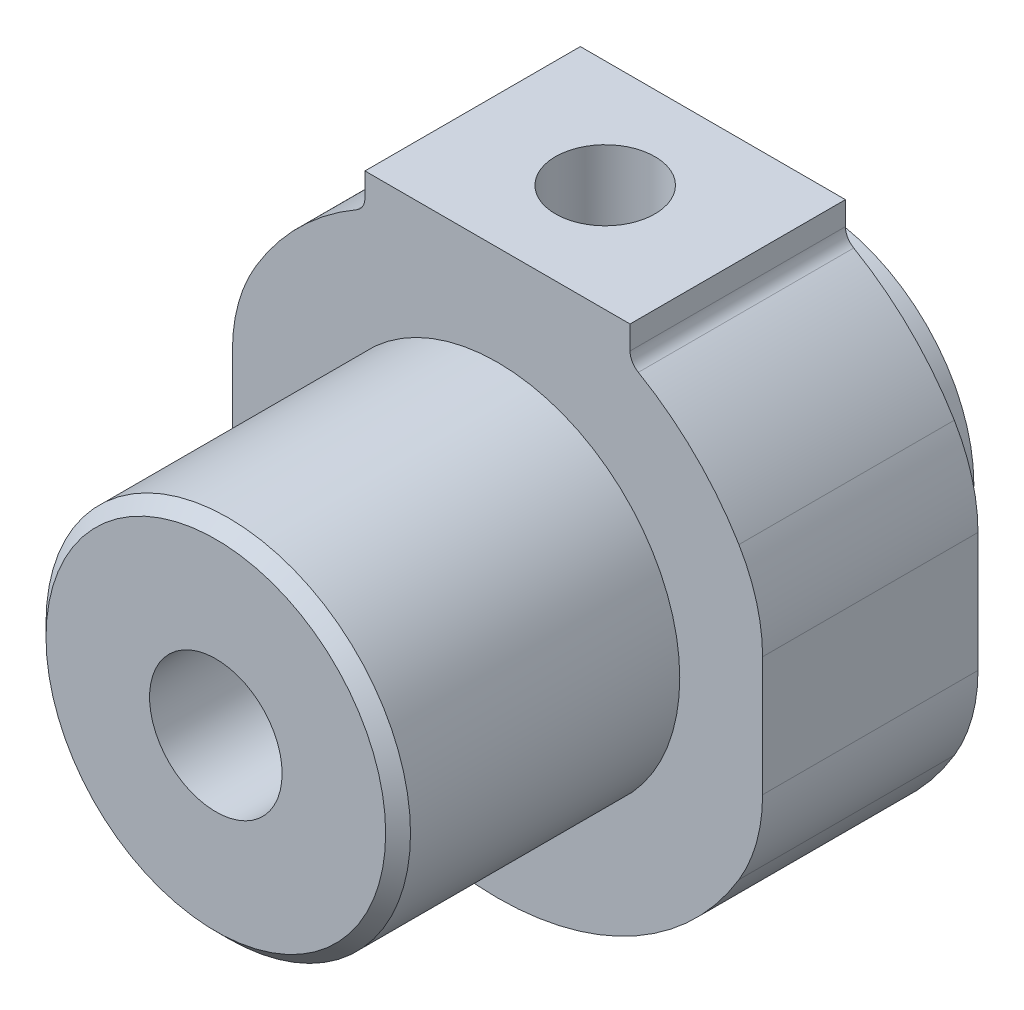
ISO-10303-21;
HEADER;
FILE_DESCRIPTION(('STEP AP214'),'2;1');
FILE_NAME('part.step','',(''),(''),'','','');
FILE_SCHEMA(('AUTOMOTIVE_DESIGN { 1 0 10303 214 1 1 1 1 }'));
ENDSEC;
DATA;
#1=APPLICATION_CONTEXT('core data for automotive mechanical design processes');
#2=APPLICATION_PROTOCOL_DEFINITION('international standard','automotive_design',2000,#1);
#3=PRODUCT_CONTEXT('',#1,'mechanical');
#4=PRODUCT('Part','Part','',(#3));
#5=PRODUCT_RELATED_PRODUCT_CATEGORY('part','',(#4));
#6=PRODUCT_DEFINITION_FORMATION('','',#4);
#7=PRODUCT_DEFINITION_CONTEXT('part definition',#1,'design');
#8=PRODUCT_DEFINITION('design','',#6,#7);
#9=PRODUCT_DEFINITION_SHAPE('','',#8);
#10=(LENGTH_UNIT() NAMED_UNIT(*) SI_UNIT(.MILLI.,.METRE.));
#11=(NAMED_UNIT(*) PLANE_ANGLE_UNIT() SI_UNIT($,.RADIAN.));
#12=(NAMED_UNIT(*) SI_UNIT($,.STERADIAN.) SOLID_ANGLE_UNIT());
#13=UNCERTAINTY_MEASURE_WITH_UNIT(LENGTH_MEASURE(1.E-05),#10,'distance_accuracy_value','');
#14=(GEOMETRIC_REPRESENTATION_CONTEXT(3) GLOBAL_UNCERTAINTY_ASSIGNED_CONTEXT((#13)) GLOBAL_UNIT_ASSIGNED_CONTEXT((#10,
#11,#12)) REPRESENTATION_CONTEXT('',''));
#15=CARTESIAN_POINT('',(0.,0.,0.));
#16=DIRECTION('',(0.,0.,1.));
#17=DIRECTION('',(1.,0.,0.));
#18=AXIS2_PLACEMENT_3D('',#15,#16,#17);
#19=CARTESIAN_POINT('',(0.,0.,13.));
#20=DIRECTION('',(0.,0.,-1.));
#21=DIRECTION('',(-1.,0.,0.));
#22=AXIS2_PLACEMENT_3D('',#19,#20,#21);
#23=CYLINDRICAL_SURFACE('',#22,17.);
#24=CARTESIAN_POINT('',(0.,0.,13.));
#25=DIRECTION('',(0.,0.,1.));
#26=DIRECTION('',(1.,0.,0.));
#27=AXIS2_PLACEMENT_3D('',#24,#25,#26);
#28=CIRCLE('',#27,17.);
#29=CARTESIAN_POINT('',(-14.5714285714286,-8.75633881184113,13.));
#30=VERTEX_POINT('',#29);
#31=CARTESIAN_POINT('',(14.5714285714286,-8.75633881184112,13.));
#32=VERTEX_POINT('',#31);
#33=EDGE_CURVE('E190',#30,#32,#28,.T.);
#34=ORIENTED_EDGE('',*,*,#33,.F.);
#35=DIRECTION('',(0.,0.,-1.));
#36=VECTOR('',#35,1.);
#37=CARTESIAN_POINT('',(-14.5714285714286,-8.75633881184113,13.));
#38=LINE('',#37,#36);
#39=CARTESIAN_POINT('',(-14.5714285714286,-8.75633881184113,0.));
#40=VERTEX_POINT('',#39);
#41=EDGE_CURVE('E236',#30,#40,#38,.T.);
#42=ORIENTED_EDGE('',*,*,#41,.T.);
#43=CARTESIAN_POINT('',(0.,0.,0.));
#44=DIRECTION('',(0.,0.,1.));
#45=DIRECTION('',(1.,0.,0.));
#46=AXIS2_PLACEMENT_3D('',#43,#44,#45);
#47=CIRCLE('',#46,17.);
#48=CARTESIAN_POINT('',(14.5714285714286,-8.75633881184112,0.));
#49=VERTEX_POINT('',#48);
#50=EDGE_CURVE('E175',#40,#49,#47,.T.);
#51=ORIENTED_EDGE('',*,*,#50,.T.);
#52=DIRECTION('',(0.,0.,-1.));
#53=VECTOR('',#52,1.);
#54=CARTESIAN_POINT('',(14.5714285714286,-8.75633881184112,13.));
#55=LINE('',#54,#53);
#56=EDGE_CURVE('E233',#49,#32,#55,.F.);
#57=ORIENTED_EDGE('',*,*,#56,.T.);
#58=EDGE_LOOP('',(#34,#42,#51,#57));
#59=FACE_BOUND('',#58,.T.);
#60=ADVANCED_FACE('F28',(#59),#23,.T.);
#61=CARTESIAN_POINT('',(14.5714285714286,8.75633881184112,13.));
#62=VERTEX_POINT('',#61);
#63=CARTESIAN_POINT('',(8.49999999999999,14.7224318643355,13.));
#64=VERTEX_POINT('',#63);
#65=EDGE_CURVE('E186',#62,#64,#28,.T.);
#66=ORIENTED_EDGE('',*,*,#65,.F.);
#67=DIRECTION('',(0.,0.,-1.));
#68=VECTOR('',#67,1.);
#69=CARTESIAN_POINT('',(14.5714285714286,8.75633881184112,13.));
#70=LINE('',#69,#68);
#71=CARTESIAN_POINT('',(14.5714285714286,8.75633881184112,0.));
#72=VERTEX_POINT('',#71);
#73=EDGE_CURVE('E11',#62,#72,#70,.T.);
#74=ORIENTED_EDGE('',*,*,#73,.T.);
#75=CARTESIAN_POINT('',(8.49999999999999,14.7224318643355,0.));
#76=VERTEX_POINT('',#75);
#77=EDGE_CURVE('E170',#72,#76,#47,.T.);
#78=ORIENTED_EDGE('',*,*,#77,.T.);
#79=DIRECTION('',(0.,0.,-1.));
#80=VECTOR('',#79,1.);
#81=CARTESIAN_POINT('',(8.49999999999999,14.7224318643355,13.));
#82=LINE('',#81,#80);
#83=EDGE_CURVE('E150',#64,#76,#82,.T.);
#84=ORIENTED_EDGE('',*,*,#83,.F.);
#85=EDGE_LOOP('',(#66,#74,#78,#84));
#86=FACE_BOUND('',#85,.T.);
#87=ADVANCED_FACE('F265',(#86),#23,.T.);
#88=CARTESIAN_POINT('',(9.,15.5884572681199,0.));
#89=DIRECTION('',(0.,0.,-1.));
#90=DIRECTION('',(-1.,0.,0.));
#91=AXIS2_PLACEMENT_3D('',#88,#89,#90);
#92=PLANE('',#91);
#93=DIRECTION('',(0.,-1.,0.));
#94=VECTOR('',#93,1.);
#95=CARTESIAN_POINT('',(-16.,20.,0.));
#96=LINE('',#95,#94);
#97=CARTESIAN_POINT('',(-16.,3.60555127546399,0.));
#98=VERTEX_POINT('',#97);
#99=CARTESIAN_POINT('',(-16.,-3.60555127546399,0.));
#100=VERTEX_POINT('',#99);
#101=EDGE_CURVE('E333',#98,#100,#96,.T.);
#102=ORIENTED_EDGE('',*,*,#101,.F.);
#103=CARTESIAN_POINT('',(-6.,3.60555127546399,0.));
#104=DIRECTION('',(0.,0.,-1.));
#105=DIRECTION('',(-1.,0.,0.));
#106=AXIS2_PLACEMENT_3D('',#103,#104,#105);
#107=CIRCLE('',#106,10.);
#108=CARTESIAN_POINT('',(-14.5714285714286,8.75633881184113,0.));
#109=VERTEX_POINT('',#108);
#110=EDGE_CURVE('E231',#98,#109,#107,.T.);
#111=ORIENTED_EDGE('',*,*,#110,.T.);
#112=CARTESIAN_POINT('',(-8.5,14.7224318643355,0.));
#113=VERTEX_POINT('',#112);
#114=EDGE_CURVE('E171',#113,#109,#47,.T.);
#115=ORIENTED_EDGE('',*,*,#114,.F.);
#116=CARTESIAN_POINT('',(-9.,15.5884572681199,0.));
#117=DIRECTION('',(0.,0.,1.));
#118=DIRECTION('',(1.,0.,0.));
#119=AXIS2_PLACEMENT_3D('',#116,#117,#118);
#120=CIRCLE('',#119,1.);
#121=CARTESIAN_POINT('',(-8.,15.5884572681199,0.));
#122=VERTEX_POINT('',#121);
#123=EDGE_CURVE('E167',#113,#122,#120,.T.);
#124=ORIENTED_EDGE('',*,*,#123,.T.);
#125=DIRECTION('',(0.,-1.,0.));
#126=VECTOR('',#125,1.);
#127=CARTESIAN_POINT('',(-8.,17.,0.));
#128=LINE('',#127,#126);
#129=CARTESIAN_POINT('',(-8.,17.,0.));
#130=VERTEX_POINT('',#129);
#131=EDGE_CURVE('E161',#130,#122,#128,.T.);
#132=ORIENTED_EDGE('',*,*,#131,.F.);
#133=DIRECTION('',(1.,0.,0.));
#134=VECTOR('',#133,1.);
#135=CARTESIAN_POINT('',(-8.,17.,0.));
#136=LINE('',#135,#134);
#137=CARTESIAN_POINT('',(8.,17.,0.));
#138=VERTEX_POINT('',#137);
#139=EDGE_CURVE('E159',#130,#138,#136,.T.);
#140=ORIENTED_EDGE('',*,*,#139,.T.);
#141=DIRECTION('',(0.,-1.,0.));
#142=VECTOR('',#141,1.);
#143=CARTESIAN_POINT('',(8.,17.,0.));
#144=LINE('',#143,#142);
#145=CARTESIAN_POINT('',(8.,15.5884572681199,0.));
#146=VERTEX_POINT('',#145);
#147=EDGE_CURVE('E137',#138,#146,#144,.T.);
#148=ORIENTED_EDGE('',*,*,#147,.T.);
#149=CARTESIAN_POINT('',(9.,15.5884572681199,0.));
#150=DIRECTION('',(0.,0.,-1.));
#151=DIRECTION('',(-1.,0.,0.));
#152=AXIS2_PLACEMENT_3D('',#149,#150,#151);
#153=CIRCLE('',#152,1.);
#154=EDGE_CURVE('E148',#76,#146,#153,.T.);
#155=ORIENTED_EDGE('',*,*,#154,.F.);
#156=ORIENTED_EDGE('',*,*,#77,.F.);
#157=CARTESIAN_POINT('',(6.,3.60555127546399,0.));
#158=DIRECTION('',(0.,0.,-1.));
#159=DIRECTION('',(-1.,0.,0.));
#160=AXIS2_PLACEMENT_3D('',#157,#158,#159);
#161=CIRCLE('',#160,10.);
#162=CARTESIAN_POINT('',(16.,3.60555127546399,0.));
#163=VERTEX_POINT('',#162);
#164=EDGE_CURVE('E227',#72,#163,#161,.T.);
#165=ORIENTED_EDGE('',*,*,#164,.T.);
#166=DIRECTION('',(0.,1.,0.));
#167=VECTOR('',#166,1.);
#168=CARTESIAN_POINT('',(16.,20.,0.));
#169=LINE('',#168,#167);
#170=CARTESIAN_POINT('',(16.,-3.60555127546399,0.));
#171=VERTEX_POINT('',#170);
#172=EDGE_CURVE('E244',#171,#163,#169,.T.);
#173=ORIENTED_EDGE('',*,*,#172,.F.);
#174=CARTESIAN_POINT('',(6.,-3.60555127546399,0.));
#175=DIRECTION('',(0.,0.,-1.));
#176=DIRECTION('',(-1.,0.,0.));
#177=AXIS2_PLACEMENT_3D('',#174,#175,#176);
#178=CIRCLE('',#177,10.);
#179=EDGE_CURVE('E43',#171,#49,#178,.T.);
#180=ORIENTED_EDGE('',*,*,#179,.T.);
#181=ORIENTED_EDGE('',*,*,#50,.F.);
#182=CARTESIAN_POINT('',(-6.,-3.60555127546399,0.));
#183=DIRECTION('',(0.,0.,-1.));
#184=DIRECTION('',(-1.,0.,0.));
#185=AXIS2_PLACEMENT_3D('',#182,#183,#184);
#186=CIRCLE('',#185,10.);
#187=EDGE_CURVE('E51',#40,#100,#186,.T.);
#188=ORIENTED_EDGE('',*,*,#187,.T.);
#189=EDGE_LOOP('',(#102,#111,#115,#124,#132,#140,#148,#155,#156,#165,#173,#180,#181,#188));
#190=FACE_BOUND('',#189,.T.);
#191=CARTESIAN_POINT('',(0.,0.,0.));
#192=DIRECTION('',(0.,0.,-1.));
#193=DIRECTION('',(-1.,0.,0.));
#194=AXIS2_PLACEMENT_3D('',#191,#192,#193);
#195=CIRCLE('',#194,9.);
#196=CARTESIAN_POINT('',(-9.,0.,0.));
#197=VERTEX_POINT('',#196);
#198=EDGE_CURVE('E414',#197,#197,#195,.T.);
#199=ORIENTED_EDGE('',*,*,#198,.F.);
#200=EDGE_LOOP('',(#199));
#201=FACE_BOUND('',#200,.T.);
#202=ADVANCED_FACE('F155',(#190,#201),#92,.T.);
#203=CARTESIAN_POINT('',(9.,15.5884572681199,13.));
#204=DIRECTION('',(0.,0.,-1.));
#205=DIRECTION('',(-1.,0.,0.));
#206=AXIS2_PLACEMENT_3D('',#203,#204,#205);
#207=PLANE('',#206);
#208=CARTESIAN_POINT('',(-8.5,14.7224318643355,13.));
#209=VERTEX_POINT('',#208);
#210=CARTESIAN_POINT('',(-14.5714285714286,8.75633881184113,13.));
#211=VERTEX_POINT('',#210);
#212=EDGE_CURVE('E187',#209,#211,#28,.T.);
#213=ORIENTED_EDGE('',*,*,#212,.T.);
#214=CARTESIAN_POINT('',(-6.,3.60555127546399,13.));
#215=DIRECTION('',(0.,0.,-1.));
#216=DIRECTION('',(-1.,0.,0.));
#217=AXIS2_PLACEMENT_3D('',#214,#215,#216);
#218=CIRCLE('',#217,10.);
#219=CARTESIAN_POINT('',(-16.,3.605551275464,13.));
#220=VERTEX_POINT('',#219);
#221=EDGE_CURVE('E221',#211,#220,#218,.F.);
#222=ORIENTED_EDGE('',*,*,#221,.T.);
#223=DIRECTION('',(0.,-1.,0.));
#224=VECTOR('',#223,1.);
#225=CARTESIAN_POINT('',(-16.,15.5884572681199,13.));
#226=LINE('',#225,#224);
#227=CARTESIAN_POINT('',(-16.,-3.60555127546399,13.));
#228=VERTEX_POINT('',#227);
#229=EDGE_CURVE('E249',#220,#228,#226,.T.);
#230=ORIENTED_EDGE('',*,*,#229,.T.);
#231=CARTESIAN_POINT('',(-6.,-3.60555127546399,13.));
#232=DIRECTION('',(0.,0.,-1.));
#233=DIRECTION('',(-1.,0.,0.));
#234=AXIS2_PLACEMENT_3D('',#231,#232,#233);
#235=CIRCLE('',#234,10.);
#236=EDGE_CURVE('E219',#228,#30,#235,.F.);
#237=ORIENTED_EDGE('',*,*,#236,.T.);
#238=ORIENTED_EDGE('',*,*,#33,.T.);
#239=CARTESIAN_POINT('',(6.,-3.60555127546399,13.));
#240=DIRECTION('',(0.,0.,-1.));
#241=DIRECTION('',(-1.,0.,0.));
#242=AXIS2_PLACEMENT_3D('',#239,#240,#241);
#243=CIRCLE('',#242,10.);
#244=CARTESIAN_POINT('',(16.,-3.605551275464,13.));
#245=VERTEX_POINT('',#244);
#246=EDGE_CURVE('E217',#32,#245,#243,.F.);
#247=ORIENTED_EDGE('',*,*,#246,.T.);
#248=DIRECTION('',(0.,1.,0.));
#249=VECTOR('',#248,1.);
#250=CARTESIAN_POINT('',(16.,15.5884572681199,13.));
#251=LINE('',#250,#249);
#252=CARTESIAN_POINT('',(16.,3.60555127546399,13.));
#253=VERTEX_POINT('',#252);
#254=EDGE_CURVE('E247',#245,#253,#251,.T.);
#255=ORIENTED_EDGE('',*,*,#254,.T.);
#256=CARTESIAN_POINT('',(6.,3.60555127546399,13.));
#257=DIRECTION('',(0.,0.,-1.));
#258=DIRECTION('',(-1.,0.,0.));
#259=AXIS2_PLACEMENT_3D('',#256,#257,#258);
#260=CIRCLE('',#259,10.);
#261=EDGE_CURVE('E215',#253,#62,#260,.F.);
#262=ORIENTED_EDGE('',*,*,#261,.T.);
#263=ORIENTED_EDGE('',*,*,#65,.T.);
#264=CARTESIAN_POINT('',(9.,15.5884572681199,13.));
#265=DIRECTION('',(0.,0.,-1.));
#266=DIRECTION('',(-1.,0.,0.));
#267=AXIS2_PLACEMENT_3D('',#264,#265,#266);
#268=CIRCLE('',#267,1.);
#269=CARTESIAN_POINT('',(8.,15.5884572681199,13.));
#270=VERTEX_POINT('',#269);
#271=EDGE_CURVE('E174',#64,#270,#268,.T.);
#272=ORIENTED_EDGE('',*,*,#271,.T.);
#273=DIRECTION('',(0.,-1.,0.));
#274=VECTOR('',#273,1.);
#275=CARTESIAN_POINT('',(8.,17.,13.));
#276=LINE('',#275,#274);
#277=CARTESIAN_POINT('',(8.,17.,13.));
#278=VERTEX_POINT('',#277);
#279=EDGE_CURVE('E140',#278,#270,#276,.T.);
#280=ORIENTED_EDGE('',*,*,#279,.F.);
#281=DIRECTION('',(1.,0.,0.));
#282=VECTOR('',#281,1.);
#283=CARTESIAN_POINT('',(-8.,17.,13.));
#284=LINE('',#283,#282);
#285=CARTESIAN_POINT('',(-8.,17.,13.));
#286=VERTEX_POINT('',#285);
#287=EDGE_CURVE('E178',#286,#278,#284,.T.);
#288=ORIENTED_EDGE('',*,*,#287,.F.);
#289=DIRECTION('',(0.,-1.,0.));
#290=VECTOR('',#289,1.);
#291=CARTESIAN_POINT('',(-8.,17.,13.));
#292=LINE('',#291,#290);
#293=CARTESIAN_POINT('',(-8.,15.5884572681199,13.));
#294=VERTEX_POINT('',#293);
#295=EDGE_CURVE('E181',#286,#294,#292,.T.);
#296=ORIENTED_EDGE('',*,*,#295,.T.);
#297=CARTESIAN_POINT('',(-9.,15.5884572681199,13.));
#298=DIRECTION('',(0.,0.,1.));
#299=DIRECTION('',(1.,0.,0.));
#300=AXIS2_PLACEMENT_3D('',#297,#298,#299);
#301=CIRCLE('',#300,1.);
#302=EDGE_CURVE('E183',#209,#294,#301,.T.);
#303=ORIENTED_EDGE('',*,*,#302,.F.);
#304=EDGE_LOOP('',(#213,#222,#230,#237,#238,#247,#255,#262,#263,#272,#280,#288,#296,#303));
#305=FACE_BOUND('',#304,.T.);
#306=CARTESIAN_POINT('',(0.,0.,13.));
#307=DIRECTION('',(0.,0.,-1.));
#308=DIRECTION('',(-1.,0.,0.));
#309=AXIS2_PLACEMENT_3D('',#306,#307,#308);
#310=CIRCLE('',#309,11.);
#311=CARTESIAN_POINT('',(-11.,0.,13.));
#312=VERTEX_POINT('',#311);
#313=EDGE_CURVE('E143',#312,#312,#310,.F.);
#314=ORIENTED_EDGE('',*,*,#313,.F.);
#315=EDGE_LOOP('',(#314));
#316=FACE_BOUND('',#315,.T.);
#317=ADVANCED_FACE('F257',(#305,#316),#207,.F.);
#318=CARTESIAN_POINT('',(9.,15.5884572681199,13.));
#319=DIRECTION('',(0.,0.,-1.));
#320=DIRECTION('',(-1.,0.,0.));
#321=AXIS2_PLACEMENT_3D('',#318,#319,#320);
#322=CYLINDRICAL_SURFACE('',#321,1.);
#323=ORIENTED_EDGE('',*,*,#154,.T.);
#324=DIRECTION('',(0.,0.,-1.));
#325=VECTOR('',#324,1.);
#326=CARTESIAN_POINT('',(8.,15.5884572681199,13.));
#327=LINE('',#326,#325);
#328=EDGE_CURVE('E133',#270,#146,#327,.T.);
#329=ORIENTED_EDGE('',*,*,#328,.F.);
#330=ORIENTED_EDGE('',*,*,#271,.F.);
#331=ORIENTED_EDGE('',*,*,#83,.T.);
#332=EDGE_LOOP('',(#323,#329,#330,#331));
#333=FACE_BOUND('',#332,.T.);
#334=ADVANCED_FACE('F30',(#333),#322,.F.);
#335=CARTESIAN_POINT('',(8.,17.,13.));
#336=DIRECTION('',(1.,0.,0.));
#337=DIRECTION('',(0.,0.,-1.));
#338=AXIS2_PLACEMENT_3D('',#335,#336,#337);
#339=PLANE('',#338);
#340=ORIENTED_EDGE('',*,*,#147,.F.);
#341=DIRECTION('',(0.,0.,-1.));
#342=VECTOR('',#341,1.);
#343=CARTESIAN_POINT('',(8.,17.,13.));
#344=LINE('',#343,#342);
#345=EDGE_CURVE('E144',#278,#138,#344,.T.);
#346=ORIENTED_EDGE('',*,*,#345,.F.);
#347=ORIENTED_EDGE('',*,*,#279,.T.);
#348=ORIENTED_EDGE('',*,*,#328,.T.);
#349=EDGE_LOOP('',(#340,#346,#347,#348));
#350=FACE_BOUND('',#349,.T.);
#351=ADVANCED_FACE('F135',(#350),#339,.T.);
#352=CARTESIAN_POINT('',(-8.,17.,13.));
#353=DIRECTION('',(0.,1.,0.));
#354=DIRECTION('',(0.,0.,1.));
#355=AXIS2_PLACEMENT_3D('',#352,#353,#354);
#356=PLANE('',#355);
#357=CARTESIAN_POINT('',(0.,17.,6.5));
#358=DIRECTION('',(0.,1.,0.));
#359=DIRECTION('',(-1.,0.,0.));
#360=AXIS2_PLACEMENT_3D('',#357,#358,#359);
#361=CIRCLE('',#360,3.);
#362=CARTESIAN_POINT('',(-3.,17.,6.5));
#363=VERTEX_POINT('',#362);
#364=EDGE_CURVE('E271',#363,#363,#361,.T.);
#365=ORIENTED_EDGE('',*,*,#364,.F.);
#366=EDGE_LOOP('',(#365));
#367=FACE_BOUND('',#366,.T.);
#368=ORIENTED_EDGE('',*,*,#139,.F.);
#369=DIRECTION('',(0.,0.,-1.));
#370=VECTOR('',#369,1.);
#371=CARTESIAN_POINT('',(-8.,17.,13.));
#372=LINE('',#371,#370);
#373=EDGE_CURVE('E196',#286,#130,#372,.T.);
#374=ORIENTED_EDGE('',*,*,#373,.F.);
#375=ORIENTED_EDGE('',*,*,#287,.T.);
#376=ORIENTED_EDGE('',*,*,#345,.T.);
#377=EDGE_LOOP('',(#368,#374,#375,#376));
#378=FACE_BOUND('',#377,.T.);
#379=ADVANCED_FACE('F340',(#367,#378),#356,.T.);
#380=CARTESIAN_POINT('',(-8.,17.,13.));
#381=DIRECTION('',(1.,0.,0.));
#382=DIRECTION('',(0.,0.,-1.));
#383=AXIS2_PLACEMENT_3D('',#380,#381,#382);
#384=PLANE('',#383);
#385=ORIENTED_EDGE('',*,*,#131,.T.);
#386=DIRECTION('',(0.,0.,-1.));
#387=VECTOR('',#386,1.);
#388=CARTESIAN_POINT('',(-8.,15.5884572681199,13.));
#389=LINE('',#388,#387);
#390=EDGE_CURVE('E194',#294,#122,#389,.T.);
#391=ORIENTED_EDGE('',*,*,#390,.F.);
#392=ORIENTED_EDGE('',*,*,#295,.F.);
#393=ORIENTED_EDGE('',*,*,#373,.T.);
#394=EDGE_LOOP('',(#385,#391,#392,#393));
#395=FACE_BOUND('',#394,.T.);
#396=ADVANCED_FACE('F322',(#395),#384,.F.);
#397=CARTESIAN_POINT('',(-9.,15.5884572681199,13.));
#398=DIRECTION('',(0.,0.,-1.));
#399=DIRECTION('',(-1.,0.,0.));
#400=AXIS2_PLACEMENT_3D('',#397,#398,#399);
#401=CYLINDRICAL_SURFACE('',#400,1.);
#402=ORIENTED_EDGE('',*,*,#123,.F.);
#403=DIRECTION('',(0.,0.,-1.));
#404=VECTOR('',#403,1.);
#405=CARTESIAN_POINT('',(-8.5,14.7224318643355,13.));
#406=LINE('',#405,#404);
#407=EDGE_CURVE('E192',#209,#113,#406,.T.);
#408=ORIENTED_EDGE('',*,*,#407,.F.);
#409=ORIENTED_EDGE('',*,*,#302,.T.);
#410=ORIENTED_EDGE('',*,*,#390,.T.);
#411=EDGE_LOOP('',(#402,#408,#409,#410));
#412=FACE_BOUND('',#411,.T.);
#413=ADVANCED_FACE('F313',(#412),#401,.F.);
#414=ORIENTED_EDGE('',*,*,#114,.T.);
#415=DIRECTION('',(0.,0.,-1.));
#416=VECTOR('',#415,1.);
#417=CARTESIAN_POINT('',(-14.5714285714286,8.75633881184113,13.));
#418=LINE('',#417,#416);
#419=EDGE_CURVE('E207',#109,#211,#418,.F.);
#420=ORIENTED_EDGE('',*,*,#419,.T.);
#421=ORIENTED_EDGE('',*,*,#212,.F.);
#422=ORIENTED_EDGE('',*,*,#407,.T.);
#423=EDGE_LOOP('',(#414,#420,#421,#422));
#424=FACE_BOUND('',#423,.T.);
#425=ADVANCED_FACE('F305',(#424),#23,.T.);
#426=CARTESIAN_POINT('',(0.,0.,30.));
#427=DIRECTION('',(0.,0.,-1.));
#428=DIRECTION('',(-1.,0.,0.));
#429=AXIS2_PLACEMENT_3D('',#426,#427,#428);
#430=CYLINDRICAL_SURFACE('',#429,11.);
#431=CARTESIAN_POINT('',(0.,0.,29.25));
#432=DIRECTION('',(0.,0.,1.));
#433=DIRECTION('',(1.,0.,0.));
#434=AXIS2_PLACEMENT_3D('',#431,#432,#433);
#435=CIRCLE('',#434,11.);
#436=CARTESIAN_POINT('',(11.,0.,29.25));
#437=VERTEX_POINT('',#436);
#438=EDGE_CURVE('E204',#437,#437,#435,.F.);
#439=ORIENTED_EDGE('',*,*,#438,.T.);
#440=EDGE_LOOP('',(#439));
#441=FACE_BOUND('',#440,.T.);
#442=ORIENTED_EDGE('',*,*,#313,.T.);
#443=EDGE_LOOP('',(#442));
#444=FACE_BOUND('',#443,.T.);
#445=ADVANCED_FACE('F312',(#441,#444),#430,.T.);
#446=CARTESIAN_POINT('',(0.,0.,30.));
#447=DIRECTION('',(0.,0.,1.));
#448=DIRECTION('',(1.,0.,0.));
#449=AXIS2_PLACEMENT_3D('',#446,#447,#448);
#450=PLANE('',#449);
#451=CARTESIAN_POINT('',(0.,0.,30.));
#452=DIRECTION('',(0.,0.,1.));
#453=DIRECTION('',(1.,0.,0.));
#454=AXIS2_PLACEMENT_3D('',#451,#452,#453);
#455=CIRCLE('',#454,4.);
#456=CARTESIAN_POINT('',(4.,0.,30.));
#457=VERTEX_POINT('',#456);
#458=EDGE_CURVE('E212',#457,#457,#455,.T.);
#459=ORIENTED_EDGE('',*,*,#458,.F.);
#460=EDGE_LOOP('',(#459));
#461=FACE_BOUND('',#460,.T.);
#462=CARTESIAN_POINT('',(0.,0.,30.));
#463=DIRECTION('',(0.,0.,1.));
#464=DIRECTION('',(1.,0.,0.));
#465=AXIS2_PLACEMENT_3D('',#462,#463,#464);
#466=CIRCLE('',#465,10.25);
#467=CARTESIAN_POINT('',(10.25,0.,30.));
#468=VERTEX_POINT('',#467);
#469=EDGE_CURVE('E201',#468,#468,#466,.T.);
#470=ORIENTED_EDGE('',*,*,#469,.T.);
#471=EDGE_LOOP('',(#470));
#472=FACE_BOUND('',#471,.T.);
#473=ADVANCED_FACE('F319',(#461,#472),#450,.T.);
#474=CARTESIAN_POINT('',(0.,0.,30.));
#475=DIRECTION('',(0.,0.,-1.));
#476=DIRECTION('',(-1.,0.,0.));
#477=AXIS2_PLACEMENT_3D('',#474,#475,#476);
#478=CONICAL_SURFACE('',#477,10.25,0.785398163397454);
#479=ORIENTED_EDGE('',*,*,#438,.F.);
#480=EDGE_LOOP('',(#479));
#481=FACE_BOUND('',#480,.T.);
#482=ORIENTED_EDGE('',*,*,#469,.F.);
#483=EDGE_LOOP('',(#482));
#484=FACE_BOUND('',#483,.T.);
#485=ADVANCED_FACE('F362',(#481,#484),#478,.T.);
#486=CARTESIAN_POINT('',(0.,0.,-3.));
#487=DIRECTION('',(0.,0.,1.));
#488=DIRECTION('',(1.,0.,0.));
#489=AXIS2_PLACEMENT_3D('',#486,#487,#488);
#490=CYLINDRICAL_SURFACE('',#489,9.);
#491=CARTESIAN_POINT('',(0.,0.,-3.));
#492=DIRECTION('',(0.,0.,-1.));
#493=DIRECTION('',(-1.,0.,0.));
#494=AXIS2_PLACEMENT_3D('',#491,#492,#493);
#495=CIRCLE('',#494,9.);
#496=CARTESIAN_POINT('',(-9.,0.,-3.));
#497=VERTEX_POINT('',#496);
#498=EDGE_CURVE('E152',#497,#497,#495,.T.);
#499=ORIENTED_EDGE('',*,*,#498,.F.);
#500=EDGE_LOOP('',(#499));
#501=FACE_BOUND('',#500,.T.);
#502=ORIENTED_EDGE('',*,*,#198,.T.);
#503=EDGE_LOOP('',(#502));
#504=FACE_BOUND('',#503,.T.);
#505=ADVANCED_FACE('F366',(#501,#504),#490,.T.);
#506=CARTESIAN_POINT('',(0.,0.,-3.));
#507=DIRECTION('',(0.,0.,-1.));
#508=DIRECTION('',(-1.,0.,0.));
#509=AXIS2_PLACEMENT_3D('',#506,#507,#508);
#510=PLANE('',#509);
#511=CARTESIAN_POINT('',(0.,0.,-3.));
#512=DIRECTION('',(0.,0.,-1.));
#513=DIRECTION('',(-1.,0.,0.));
#514=AXIS2_PLACEMENT_3D('',#511,#512,#513);
#515=CIRCLE('',#514,9.75);
#516=CARTESIAN_POINT('',(-9.75,0.,-3.));
#517=VERTEX_POINT('',#516);
#518=EDGE_CURVE('E408',#517,#517,#515,.T.);
#519=ORIENTED_EDGE('',*,*,#518,.F.);
#520=EDGE_LOOP('',(#519));
#521=FACE_BOUND('',#520,.T.);
#522=ORIENTED_EDGE('',*,*,#498,.T.);
#523=EDGE_LOOP('',(#522));
#524=FACE_BOUND('',#523,.T.);
#525=ADVANCED_FACE('F370',(#521,#524),#510,.F.);
#526=CARTESIAN_POINT('',(0.,0.,-6.));
#527=DIRECTION('',(0.,0.,1.));
#528=DIRECTION('',(1.,0.,0.));
#529=AXIS2_PLACEMENT_3D('',#526,#527,#528);
#530=CYLINDRICAL_SURFACE('',#529,9.75);
#531=CARTESIAN_POINT('',(0.,0.,-6.));
#532=DIRECTION('',(0.,0.,-1.));
#533=DIRECTION('',(-1.,0.,0.));
#534=AXIS2_PLACEMENT_3D('',#531,#532,#533);
#535=CIRCLE('',#534,9.75);
#536=CARTESIAN_POINT('',(-9.75,0.,-6.));
#537=VERTEX_POINT('',#536);
#538=EDGE_CURVE('E411',#537,#537,#535,.T.);
#539=ORIENTED_EDGE('',*,*,#538,.F.);
#540=EDGE_LOOP('',(#539));
#541=FACE_BOUND('',#540,.T.);
#542=ORIENTED_EDGE('',*,*,#518,.T.);
#543=EDGE_LOOP('',(#542));
#544=FACE_BOUND('',#543,.T.);
#545=ADVANCED_FACE('F372',(#541,#544),#530,.T.);
#546=CARTESIAN_POINT('',(0.,0.,-6.));
#547=DIRECTION('',(0.,0.,-1.));
#548=DIRECTION('',(-1.,0.,0.));
#549=AXIS2_PLACEMENT_3D('',#546,#547,#548);
#550=PLANE('',#549);
#551=CARTESIAN_POINT('',(0.,0.,-6.));
#552=DIRECTION('',(0.,0.,-1.));
#553=DIRECTION('',(-1.,0.,0.));
#554=AXIS2_PLACEMENT_3D('',#551,#552,#553);
#555=CIRCLE('',#554,5.);
#556=CARTESIAN_POINT('',(-5.,0.,-6.));
#557=VERTEX_POINT('',#556);
#558=EDGE_CURVE('E211',#557,#557,#555,.T.);
#559=ORIENTED_EDGE('',*,*,#558,.F.);
#560=EDGE_LOOP('',(#559));
#561=FACE_BOUND('',#560,.T.);
#562=ORIENTED_EDGE('',*,*,#538,.T.);
#563=EDGE_LOOP('',(#562));
#564=FACE_BOUND('',#563,.T.);
#565=ADVANCED_FACE('F375',(#561,#564),#550,.T.);
#566=CARTESIAN_POINT('',(0.,0.,14.));
#567=DIRECTION('',(0.,0.,-1.));
#568=DIRECTION('',(-1.,0.,0.));
#569=AXIS2_PLACEMENT_3D('',#566,#567,#568);
#570=CYLINDRICAL_SURFACE('',#569,5.);
#571=CARTESIAN_POINT('',(-3.,4.,6.5));
#572=CARTESIAN_POINT('',(-2.9999999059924,3.99999997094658,6.42453838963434));
#573=CARTESIAN_POINT('',(-2.99714660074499,4.00214560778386,6.34908004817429));
#574=CARTESIAN_POINT('',(-2.98579602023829,4.01061905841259,6.19881642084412));
#575=CARTESIAN_POINT('',(-2.97729658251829,4.01694847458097,6.12401139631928));
#576=CARTESIAN_POINT('',(-2.94350195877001,4.04185988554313,5.90145759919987));
#577=CARTESIAN_POINT('',(-2.90991036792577,4.06636523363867,5.75553383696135));
#578=CARTESIAN_POINT('',(-2.82286888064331,4.12724466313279,5.47380470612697));
#579=CARTESIAN_POINT('',(-2.76956233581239,4.16353284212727,5.33793459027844));
#580=CARTESIAN_POINT('',(-2.64505893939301,4.24371857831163,5.07713282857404));
#581=CARTESIAN_POINT('',(-2.57385675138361,4.28761840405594,4.95220446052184));
#582=CARTESIAN_POINT('',(-2.40542341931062,4.3845721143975,4.70009868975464));
#583=CARTESIAN_POINT('',(-2.30607419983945,4.43808896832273,4.57451391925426));
#584=CARTESIAN_POINT('',(-2.08854542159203,4.54452303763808,4.34047464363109));
#585=CARTESIAN_POINT('',(-1.97035175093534,4.59743977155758,4.23203309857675));
#586=CARTESIAN_POINT('',(-1.70284578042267,4.70351798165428,4.02371753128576));
#587=CARTESIAN_POINT('',(-1.55155129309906,4.75608869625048,3.92603358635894));
#588=CARTESIAN_POINT('',(-1.31132430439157,4.82570563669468,3.80025349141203));
#589=CARTESIAN_POINT('',(-1.22900736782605,4.84737661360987,3.76177588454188));
#590=CARTESIAN_POINT('',(-1.06047221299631,4.88701002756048,3.69220903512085));
#591=CARTESIAN_POINT('',(-0.974256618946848,4.90497491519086,3.66111490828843));
#592=CARTESIAN_POINT('',(-0.806968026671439,4.9351119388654,3.60937253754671));
#593=CARTESIAN_POINT('',(-0.726184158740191,4.94767216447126,3.5880127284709));
#594=CARTESIAN_POINT('',(-0.562666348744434,4.96892323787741,3.55205003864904));
#595=CARTESIAN_POINT('',(-0.479933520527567,4.97761624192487,3.5374433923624));
#596=CARTESIAN_POINT('',(-0.313244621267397,4.99087754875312,3.51521531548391));
#597=CARTESIAN_POINT('',(-0.229289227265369,4.99544805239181,3.5075901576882));
#598=CARTESIAN_POINT('',(-0.0609397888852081,5.00033941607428,3.49943336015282));
#599=CARTESIAN_POINT('',(0.0234542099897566,5.00066070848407,3.49890099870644));
#600=CARTESIAN_POINT('',(0.255171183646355,4.99565270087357,3.50724278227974));
#601=CARTESIAN_POINT('',(0.402219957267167,4.98590479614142,3.52347114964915));
#602=CARTESIAN_POINT('',(0.690956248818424,4.95416390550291,3.57695549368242));
#603=CARTESIAN_POINT('',(0.832643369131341,4.9321700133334,3.6142130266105));
#604=CARTESIAN_POINT('',(1.10810607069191,4.87769707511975,3.70833223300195));
#605=CARTESIAN_POINT('',(1.2418309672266,4.84515792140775,3.76530642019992));
#606=CARTESIAN_POINT('',(1.49797933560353,4.77219304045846,3.89676893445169));
#607=CARTESIAN_POINT('',(1.62039986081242,4.73176526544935,3.97126181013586));
#608=CARTESIAN_POINT('',(1.86614789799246,4.64075842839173,4.14567827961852));
#609=CARTESIAN_POINT('',(1.98783715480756,4.58954363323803,4.2475766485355));
#610=CARTESIAN_POINT('',(2.2134294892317,4.48511110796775,4.46880821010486));
#611=CARTESIAN_POINT('',(2.31730807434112,4.43189074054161,4.58816499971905));
#612=CARTESIAN_POINT('',(2.51649670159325,4.32222149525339,4.85730682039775));
#613=CARTESIAN_POINT('',(2.60941864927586,4.26611322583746,5.0090151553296));
#614=CARTESIAN_POINT('',(2.76794435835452,4.16501759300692,5.32941246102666));
#615=CARTESIAN_POINT('',(2.83359844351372,4.12000980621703,5.49806943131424));
#616=CARTESIAN_POINT('',(2.92154993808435,4.05791730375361,5.80478726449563));
#617=CARTESIAN_POINT('',(2.95055806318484,4.03667777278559,5.94008126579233));
#618=CARTESIAN_POINT('',(2.98961745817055,4.00784301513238,6.21474721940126));
#619=CARTESIAN_POINT('',(2.9996907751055,4.00023192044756,6.3541142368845));
#620=CARTESIAN_POINT('',(3.00029561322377,3.9997782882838,6.63310336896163));
#621=CARTESIAN_POINT('',(2.99080006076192,4.00695621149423,6.77272556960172));
#622=CARTESIAN_POINT('',(2.95280584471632,4.03503040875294,7.04797467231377));
#623=CARTESIAN_POINT('',(2.92429216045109,4.05593752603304,7.18359832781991));
#624=CARTESIAN_POINT('',(2.84976612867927,4.10863539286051,7.44742921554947));
#625=CARTESIAN_POINT('',(2.80377564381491,4.14041253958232,7.57564548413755));
#626=CARTESIAN_POINT('',(2.69592568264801,4.21143069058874,7.82295522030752));
#627=CARTESIAN_POINT('',(2.63406022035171,4.25067450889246,7.9420452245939));
#628=CARTESIAN_POINT('',(2.48334675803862,4.34073681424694,8.1904810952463));
#629=CARTESIAN_POINT('',(2.391645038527,4.39236652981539,8.31780543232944));
#630=CARTESIAN_POINT('',(2.18975614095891,4.49643335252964,8.55656720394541));
#631=CARTESIAN_POINT('',(2.07955127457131,4.54887118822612,8.66798924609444));
#632=CARTESIAN_POINT('',(1.82651475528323,4.65671991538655,8.88646399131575));
#633=CARTESIAN_POINT('',(1.68130397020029,4.71163080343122,8.99106470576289));
#634=CARTESIAN_POINT('',(1.44944631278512,4.78599458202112,9.12815449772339));
#635=CARTESIAN_POINT('',(1.36978605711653,4.80945640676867,9.17056200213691));
#636=CARTESIAN_POINT('',(1.20623656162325,4.85305400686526,9.24830388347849));
#637=CARTESIAN_POINT('',(1.12235002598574,4.87319187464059,9.2836427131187));
#638=CARTESIAN_POINT('',(0.957140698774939,4.90820667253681,9.34447964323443));
#639=CARTESIAN_POINT('',(0.876069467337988,4.9233583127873,9.37050371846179));
#640=CARTESIAN_POINT('',(0.711460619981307,4.94982497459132,9.41566498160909));
#641=CARTESIAN_POINT('',(0.627924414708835,4.96114214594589,9.43480602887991));
#642=CARTESIAN_POINT('',(0.459119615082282,4.9795990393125,9.4659003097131));
#643=CARTESIAN_POINT('',(0.373852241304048,4.98674160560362,9.47785843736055));
#644=CARTESIAN_POINT('',(0.202384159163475,4.99664216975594,9.49440676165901));
#645=CARTESIAN_POINT('',(0.116183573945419,4.99940073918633,9.49899791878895));
#646=CARTESIAN_POINT('',(-0.11951938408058,5.00079353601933,9.5013282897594));
#647=CARTESIAN_POINT('',(-0.269213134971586,4.9949361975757,9.4916010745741));
#648=CARTESIAN_POINT('',(-0.564325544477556,4.97026391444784,9.45021794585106));
#649=CARTESIAN_POINT('',(-0.70974415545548,4.95144882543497,9.41856178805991));
#650=CARTESIAN_POINT('',(-0.990283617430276,4.90298726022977,9.33555942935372));
#651=CARTESIAN_POINT('',(-1.1255320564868,4.87351900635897,9.284536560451));
#652=CARTESIAN_POINT('',(-1.38556595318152,4.8060670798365,9.16471905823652));
#653=CARTESIAN_POINT('',(-1.51034905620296,4.76808149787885,9.09592043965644));
#654=CARTESIAN_POINT('',(-1.76052652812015,4.68186861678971,8.93415009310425));
#655=CARTESIAN_POINT('',(-1.88451663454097,4.63297714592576,8.83936493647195));
#656=CARTESIAN_POINT('',(-2.11579577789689,4.5320378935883,8.63249157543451));
#657=CARTESIAN_POINT('',(-2.22306604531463,4.47998665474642,8.52038420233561));
#658=CARTESIAN_POINT('',(-2.43181699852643,4.37056449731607,8.26543895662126));
#659=CARTESIAN_POINT('',(-2.53083841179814,4.31335603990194,8.12050691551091));
#660=CARTESIAN_POINT('',(-2.70314606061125,4.20752457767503,7.81299042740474));
#661=CARTESIAN_POINT('',(-2.77644567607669,4.15889711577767,7.65041521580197));
#662=CARTESIAN_POINT('',(-2.86193484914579,4.10004730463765,7.40337744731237));
#663=CARTESIAN_POINT('',(-2.88571236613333,4.0832950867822,7.32434140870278));
#664=CARTESIAN_POINT('',(-2.92679381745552,4.05395087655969,7.16386955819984));
#665=CARTESIAN_POINT('',(-2.94410184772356,4.04135625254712,7.08243530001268));
#666=CARTESIAN_POINT('',(-2.97191221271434,4.0209497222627,6.91795344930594));
#667=CARTESIAN_POINT('',(-2.98242533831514,4.01313023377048,6.83490863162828));
#668=CARTESIAN_POINT('',(-2.99646884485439,4.00265571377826,6.66790778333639));
#669=CARTESIAN_POINT('',(-3.00000010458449,4.00000003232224,6.58395186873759));
#670=CARTESIAN_POINT('',(-3.,4.,6.5));
#671=B_SPLINE_CURVE_WITH_KNOTS('',3,(#571,#572,#573,#574,#575,#576,#577,#578,#579,#580,#581,
#582,#583,#584,#585,#586,#587,#588,#589,#590,#591,#592,#593,#594,#595,#596,#597,#598,#599,#600,
#601,#602,#603,#604,#605,#606,#607,#608,#609,#610,#611,#612,#613,#614,#615,#616,#617,#618,#619,
#620,#621,#622,#623,#624,#625,#626,#627,#628,#629,#630,#631,#632,#633,#634,#635,#636,#637,#638,
#639,#640,#641,#642,#643,#644,#645,#646,#647,#648,#649,#650,#651,#652,#653,#654,#655,#656,#657,
#658,#659,#660,#661,#662,#663,#664,#665,#666,#667,#668,#669,#670),.UNSPECIFIED.,.T.,.F.,(4,2,2,
2,2,2,2,2,2,2,2,2,2,2,2,2,2,2,2,2,2,2,2,2,2,2,2,2,2,2,2,2,2,2,2,2,2,2,2,2,2,2,2,2,2,2,2,2,2,4),
(0.,0.226288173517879,0.452663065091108,0.905305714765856,1.35471981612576,1.80426809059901,
2.30878181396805,2.81367513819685,3.37309572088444,3.65297634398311,3.93267130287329,
4.18580566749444,4.43879871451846,4.69165661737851,4.94448879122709,5.38694235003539,
5.82942865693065,6.27448283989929,6.71965270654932,7.21799594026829,7.71701907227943,
8.27387316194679,8.82969494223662,9.24786570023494,9.66554925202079,10.0838110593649,
10.5024036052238,10.9204742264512,11.3387027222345,11.8323285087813,12.3264288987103,
12.884776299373,13.1641700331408,13.4433872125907,13.7024631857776,13.9613936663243,
14.2201475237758,14.4788676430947,14.9267946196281,15.3747265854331,15.8154875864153,
16.2563474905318,16.7450674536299,17.2343321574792,17.7856420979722,18.3366648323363,
18.5890061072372,18.8411873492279,19.0929671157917,19.3447151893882),.UNSPECIFIED.);
#672=CARTESIAN_POINT('',(-3.,4.,6.5));
#673=VERTEX_POINT('',#672);
#674=EDGE_CURVE('E268',#673,#673,#671,.T.);
#675=ORIENTED_EDGE('',*,*,#674,.F.);
#676=EDGE_LOOP('',(#675));
#677=FACE_BOUND('',#676,.T.);
#678=CARTESIAN_POINT('',(0.,0.,14.));
#679=DIRECTION('',(0.,0.,-1.));
#680=DIRECTION('',(-1.,0.,0.));
#681=AXIS2_PLACEMENT_3D('',#678,#679,#680);
#682=CIRCLE('',#681,5.);
#683=CARTESIAN_POINT('',(-5.,0.,14.));
#684=VERTEX_POINT('',#683);
#685=EDGE_CURVE('E405',#684,#684,#682,.T.);
#686=ORIENTED_EDGE('',*,*,#685,.F.);
#687=EDGE_LOOP('',(#686));
#688=FACE_BOUND('',#687,.T.);
#689=ORIENTED_EDGE('',*,*,#558,.T.);
#690=EDGE_LOOP('',(#689));
#691=FACE_BOUND('',#690,.T.);
#692=ADVANCED_FACE('F379',(#677,#688,#691),#570,.F.);
#693=CARTESIAN_POINT('',(0.,0.,14.));
#694=DIRECTION('',(0.,0.,-1.));
#695=DIRECTION('',(-1.,0.,0.));
#696=AXIS2_PLACEMENT_3D('',#693,#694,#695);
#697=PLANE('',#696);
#698=CARTESIAN_POINT('',(0.,0.,14.));
#699=DIRECTION('',(0.,0.,-1.));
#700=DIRECTION('',(-1.,0.,0.));
#701=AXIS2_PLACEMENT_3D('',#698,#699,#700);
#702=CIRCLE('',#701,4.);
#703=CARTESIAN_POINT('',(-4.,0.,14.));
#704=VERTEX_POINT('',#703);
#705=EDGE_CURVE('E208',#704,#704,#702,.T.);
#706=ORIENTED_EDGE('',*,*,#705,.F.);
#707=EDGE_LOOP('',(#706));
#708=FACE_BOUND('',#707,.T.);
#709=ORIENTED_EDGE('',*,*,#685,.T.);
#710=EDGE_LOOP('',(#709));
#711=FACE_BOUND('',#710,.T.);
#712=ADVANCED_FACE('F386',(#708,#711),#697,.T.);
#713=CARTESIAN_POINT('',(0.,0.,-6.));
#714=DIRECTION('',(0.,0.,1.));
#715=DIRECTION('',(1.,0.,0.));
#716=AXIS2_PLACEMENT_3D('',#713,#714,#715);
#717=CYLINDRICAL_SURFACE('',#716,4.);
#718=ORIENTED_EDGE('',*,*,#705,.T.);
#719=EDGE_LOOP('',(#718));
#720=FACE_BOUND('',#719,.T.);
#721=ORIENTED_EDGE('',*,*,#458,.T.);
#722=EDGE_LOOP('',(#721));
#723=FACE_BOUND('',#722,.T.);
#724=ADVANCED_FACE('F389',(#720,#723),#717,.F.);
#725=CARTESIAN_POINT('',(0.,-17.001,6.5));
#726=DIRECTION('',(0.,1.,0.));
#727=DIRECTION('',(-1.,0.,0.));
#728=AXIS2_PLACEMENT_3D('',#725,#726,#727);
#729=CYLINDRICAL_SURFACE('',#728,3.);
#730=ORIENTED_EDGE('',*,*,#364,.T.);
#731=EDGE_LOOP('',(#730));
#732=FACE_BOUND('',#731,.T.);
#733=ORIENTED_EDGE('',*,*,#674,.T.);
#734=EDGE_LOOP('',(#733));
#735=FACE_BOUND('',#734,.T.);
#736=ADVANCED_FACE('F280',(#732,#735),#729,.F.);
#737=CARTESIAN_POINT('',(16.,20.,30.));
#738=DIRECTION('',(-1.,0.,0.));
#739=DIRECTION('',(0.,-1.,0.));
#740=AXIS2_PLACEMENT_3D('',#737,#738,#739);
#741=PLANE('',#740);
#742=ORIENTED_EDGE('',*,*,#254,.F.);
#743=DIRECTION('',(0.,0.,-1.));
#744=VECTOR('',#743,1.);
#745=CARTESIAN_POINT('',(16.,-3.60555127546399,30.));
#746=LINE('',#745,#744);
#747=EDGE_CURVE('E36',#245,#171,#746,.T.);
#748=ORIENTED_EDGE('',*,*,#747,.T.);
#749=ORIENTED_EDGE('',*,*,#172,.T.);
#750=DIRECTION('',(0.,0.,-1.));
#751=VECTOR('',#750,1.);
#752=CARTESIAN_POINT('',(16.,3.60555127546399,30.));
#753=LINE('',#752,#751);
#754=EDGE_CURVE('E238',#163,#253,#753,.F.);
#755=ORIENTED_EDGE('',*,*,#754,.T.);
#756=EDGE_LOOP('',(#742,#748,#749,#755));
#757=FACE_BOUND('',#756,.T.);
#758=ADVANCED_FACE('F243',(#757),#741,.F.);
#759=CARTESIAN_POINT('',(-16.,20.,30.));
#760=DIRECTION('',(1.,0.,0.));
#761=DIRECTION('',(0.,1.,0.));
#762=AXIS2_PLACEMENT_3D('',#759,#760,#761);
#763=PLANE('',#762);
#764=ORIENTED_EDGE('',*,*,#229,.F.);
#765=DIRECTION('',(0.,0.,-1.));
#766=VECTOR('',#765,1.);
#767=CARTESIAN_POINT('',(-16.,3.60555127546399,30.));
#768=LINE('',#767,#766);
#769=EDGE_CURVE('E225',#220,#98,#768,.T.);
#770=ORIENTED_EDGE('',*,*,#769,.T.);
#771=ORIENTED_EDGE('',*,*,#101,.T.);
#772=DIRECTION('',(0.,0.,-1.));
#773=VECTOR('',#772,1.);
#774=CARTESIAN_POINT('',(-16.,-3.60555127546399,30.));
#775=LINE('',#774,#773);
#776=EDGE_CURVE('E223',#100,#228,#775,.F.);
#777=ORIENTED_EDGE('',*,*,#776,.T.);
#778=EDGE_LOOP('',(#764,#770,#771,#777));
#779=FACE_BOUND('',#778,.T.);
#780=ADVANCED_FACE('F287',(#779),#763,.F.);
#781=CARTESIAN_POINT('',(-6.,3.60555127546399,13.));
#782=DIRECTION('',(0.,0.,-1.));
#783=DIRECTION('',(-1.,0.,0.));
#784=AXIS2_PLACEMENT_3D('',#781,#782,#783);
#785=CYLINDRICAL_SURFACE('',#784,10.);
#786=ORIENTED_EDGE('',*,*,#110,.F.);
#787=ORIENTED_EDGE('',*,*,#769,.F.);
#788=ORIENTED_EDGE('',*,*,#221,.F.);
#789=ORIENTED_EDGE('',*,*,#419,.F.);
#790=EDGE_LOOP('',(#786,#787,#788,#789));
#791=FACE_BOUND('',#790,.T.);
#792=ADVANCED_FACE('F290',(#791),#785,.T.);
#793=CARTESIAN_POINT('',(-6.,-3.60555127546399,13.));
#794=DIRECTION('',(0.,0.,-1.));
#795=DIRECTION('',(-1.,0.,0.));
#796=AXIS2_PLACEMENT_3D('',#793,#794,#795);
#797=CYLINDRICAL_SURFACE('',#796,10.);
#798=ORIENTED_EDGE('',*,*,#236,.F.);
#799=ORIENTED_EDGE('',*,*,#776,.F.);
#800=ORIENTED_EDGE('',*,*,#187,.F.);
#801=ORIENTED_EDGE('',*,*,#41,.F.);
#802=EDGE_LOOP('',(#798,#799,#800,#801));
#803=FACE_BOUND('',#802,.T.);
#804=ADVANCED_FACE('F294',(#803),#797,.T.);
#805=CARTESIAN_POINT('',(6.,-3.60555127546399,13.));
#806=DIRECTION('',(0.,0.,-1.));
#807=DIRECTION('',(-1.,0.,0.));
#808=AXIS2_PLACEMENT_3D('',#805,#806,#807);
#809=CYLINDRICAL_SURFACE('',#808,10.);
#810=ORIENTED_EDGE('',*,*,#179,.F.);
#811=ORIENTED_EDGE('',*,*,#747,.F.);
#812=ORIENTED_EDGE('',*,*,#246,.F.);
#813=ORIENTED_EDGE('',*,*,#56,.F.);
#814=EDGE_LOOP('',(#810,#811,#812,#813));
#815=FACE_BOUND('',#814,.T.);
#816=ADVANCED_FACE('F252',(#815),#809,.T.);
#817=CARTESIAN_POINT('',(6.,3.60555127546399,13.));
#818=DIRECTION('',(0.,0.,-1.));
#819=DIRECTION('',(-1.,0.,0.));
#820=AXIS2_PLACEMENT_3D('',#817,#818,#819);
#821=CYLINDRICAL_SURFACE('',#820,10.);
#822=ORIENTED_EDGE('',*,*,#261,.F.);
#823=ORIENTED_EDGE('',*,*,#754,.F.);
#824=ORIENTED_EDGE('',*,*,#164,.F.);
#825=ORIENTED_EDGE('',*,*,#73,.F.);
#826=EDGE_LOOP('',(#822,#823,#824,#825));
#827=FACE_BOUND('',#826,.T.);
#828=ADVANCED_FACE('F267',(#827),#821,.T.);
#829=CLOSED_SHELL('',(#60,#87,#202,#317,#334,#351,#379,#396,#413,#425,#445,#473,#485,#505,#525,
#545,#565,#692,#712,#724,#736,#758,#780,#792,#804,#816,#828));
#830=MANIFOLD_SOLID_BREP('B2',#829);
#831=ADVANCED_BREP_SHAPE_REPRESENTATION('',(#18,#830),#14);
#832=SHAPE_DEFINITION_REPRESENTATION(#9,#831);
ENDSEC;
END-ISO-10303-21;
